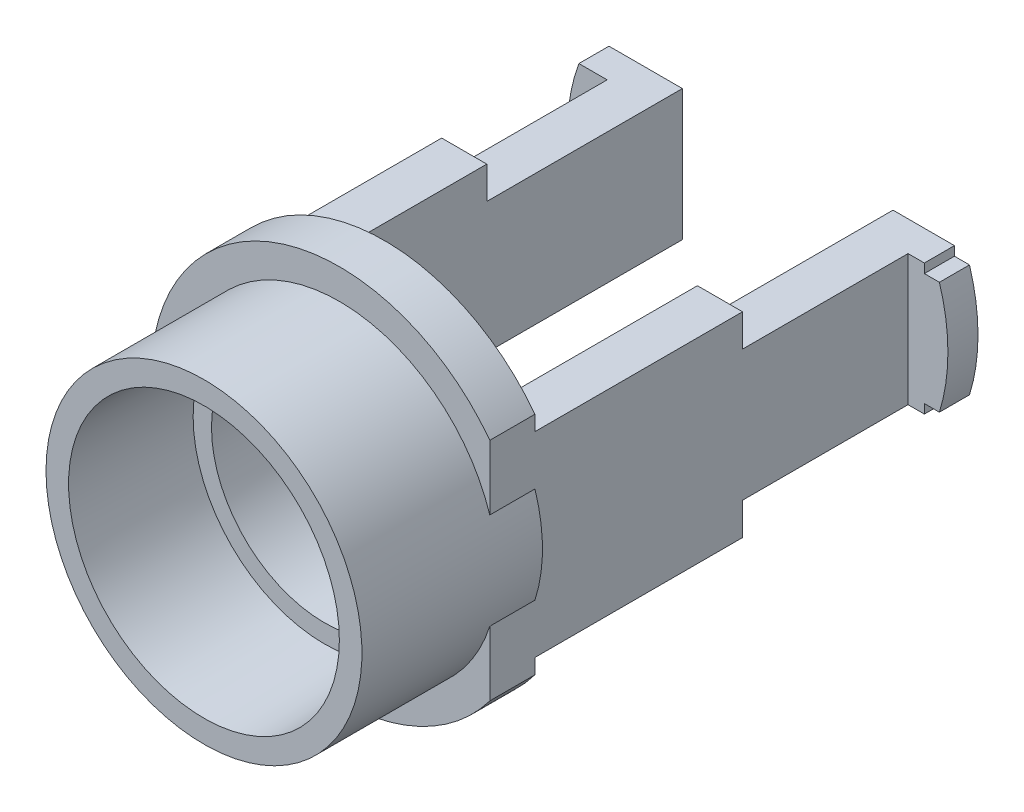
ISO-10303-21;
HEADER;
FILE_DESCRIPTION(('STEP AP214'),'2;1');
FILE_NAME('part.step','',(''),(''),'','','');
FILE_SCHEMA(('AUTOMOTIVE_DESIGN { 1 0 10303 214 1 1 1 1 }'));
ENDSEC;
DATA;
#1=APPLICATION_CONTEXT('core data for automotive mechanical design processes');
#2=APPLICATION_PROTOCOL_DEFINITION('international standard','automotive_design',2000,#1);
#3=PRODUCT_CONTEXT('',#1,'mechanical');
#4=PRODUCT('Part','Part','',(#3));
#5=PRODUCT_RELATED_PRODUCT_CATEGORY('part','',(#4));
#6=PRODUCT_DEFINITION_FORMATION('','',#4);
#7=PRODUCT_DEFINITION_CONTEXT('part definition',#1,'design');
#8=PRODUCT_DEFINITION('design','',#6,#7);
#9=PRODUCT_DEFINITION_SHAPE('','',#8);
#10=(LENGTH_UNIT() NAMED_UNIT(*) SI_UNIT(.MILLI.,.METRE.));
#11=(NAMED_UNIT(*) PLANE_ANGLE_UNIT() SI_UNIT($,.RADIAN.));
#12=(NAMED_UNIT(*) SI_UNIT($,.STERADIAN.) SOLID_ANGLE_UNIT());
#13=UNCERTAINTY_MEASURE_WITH_UNIT(LENGTH_MEASURE(1.E-05),#10,'distance_accuracy_value','');
#14=(GEOMETRIC_REPRESENTATION_CONTEXT(3) GLOBAL_UNCERTAINTY_ASSIGNED_CONTEXT((#13)) GLOBAL_UNIT_ASSIGNED_CONTEXT((#10,
#11,#12)) REPRESENTATION_CONTEXT('',''));
#15=CARTESIAN_POINT('',(0.,0.,0.));
#16=DIRECTION('',(0.,0.,1.));
#17=DIRECTION('',(1.,0.,0.));
#18=AXIS2_PLACEMENT_3D('',#15,#16,#17);
#19=CARTESIAN_POINT('',(0.,0.,-1.));
#20=DIRECTION('',(0.,0.,1.));
#21=DIRECTION('',(1.,0.,0.));
#22=AXIS2_PLACEMENT_3D('',#19,#20,#21);
#23=CYLINDRICAL_SURFACE('',#22,6.325);
#24=CARTESIAN_POINT('',(0.,0.,-0.999999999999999));
#25=DIRECTION('',(0.,0.,1.));
#26=DIRECTION('',(1.,0.,0.));
#27=AXIS2_PLACEMENT_3D('',#24,#25,#26);
#28=CIRCLE('',#27,6.325);
#29=CARTESIAN_POINT('',(-5.93927605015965,-2.17499999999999,-1.));
#30=VERTEX_POINT('',#29);
#31=CARTESIAN_POINT('',(-5.93927605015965,2.175,-1.));
#32=VERTEX_POINT('',#31);
#33=EDGE_CURVE('E17',#30,#32,#28,.F.);
#34=ORIENTED_EDGE('',*,*,#33,.F.);
#35=DIRECTION('',(0.,0.,1.));
#36=VECTOR('',#35,1.);
#37=CARTESIAN_POINT('',(-5.93927605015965,-2.17499999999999,-1.));
#38=LINE('',#37,#36);
#39=CARTESIAN_POINT('',(-5.93927605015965,-2.17499999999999,0.));
#40=VERTEX_POINT('',#39);
#41=EDGE_CURVE('E101',#30,#40,#38,.T.);
#42=ORIENTED_EDGE('',*,*,#41,.T.);
#43=CARTESIAN_POINT('',(0.,0.,0.));
#44=DIRECTION('',(0.,0.,1.));
#45=DIRECTION('',(1.,0.,0.));
#46=AXIS2_PLACEMENT_3D('',#43,#44,#45);
#47=CIRCLE('',#46,6.325);
#48=CARTESIAN_POINT('',(-5.93927605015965,2.175,0.));
#49=VERTEX_POINT('',#48);
#50=EDGE_CURVE('E206',#40,#49,#47,.F.);
#51=ORIENTED_EDGE('',*,*,#50,.T.);
#52=DIRECTION('',(0.,0.,1.));
#53=VECTOR('',#52,1.);
#54=CARTESIAN_POINT('',(-5.93927605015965,2.175,0.));
#55=LINE('',#54,#53);
#56=EDGE_CURVE('E203',#32,#49,#55,.T.);
#57=ORIENTED_EDGE('',*,*,#56,.F.);
#58=EDGE_LOOP('',(#34,#42,#51,#57));
#59=FACE_BOUND('',#58,.T.);
#60=ADVANCED_FACE('F14',(#59),#23,.T.);
#61=CARTESIAN_POINT('',(0.,0.,-1.));
#62=DIRECTION('',(0.,0.,-1.));
#63=DIRECTION('',(-1.,0.,0.));
#64=AXIS2_PLACEMENT_3D('',#61,#62,#63);
#65=PLANE('',#64);
#66=DIRECTION('',(0.,1.,0.));
#67=VECTOR('',#66,1.);
#68=CARTESIAN_POINT('',(-3.5,-3.25,-1.));
#69=LINE('',#68,#67);
#70=CARTESIAN_POINT('',(-3.5,-2.175,-1.));
#71=VERTEX_POINT('',#70);
#72=CARTESIAN_POINT('',(-3.5,2.175,-1.));
#73=VERTEX_POINT('',#72);
#74=EDGE_CURVE('E281',#71,#73,#69,.T.);
#75=ORIENTED_EDGE('',*,*,#74,.F.);
#76=DIRECTION('',(1.,0.,0.));
#77=VECTOR('',#76,1.);
#78=CARTESIAN_POINT('',(-5.,-2.175,-1.));
#79=LINE('',#78,#77);
#80=EDGE_CURVE('E198',#30,#71,#79,.T.);
#81=ORIENTED_EDGE('',*,*,#80,.F.);
#82=ORIENTED_EDGE('',*,*,#33,.T.);
#83=DIRECTION('',(1.,0.,0.));
#84=VECTOR('',#83,1.);
#85=CARTESIAN_POINT('',(-3.5,2.175,-1.));
#86=LINE('',#85,#84);
#87=EDGE_CURVE('E207',#73,#32,#86,.F.);
#88=ORIENTED_EDGE('',*,*,#87,.F.);
#89=EDGE_LOOP('',(#75,#81,#82,#88));
#90=FACE_BOUND('',#89,.T.);
#91=ADVANCED_FACE('F748',(#90),#65,.T.);
#92=CARTESIAN_POINT('',(-3.5,-3.25,12.4));
#93=DIRECTION('',(0.,0.,1.));
#94=DIRECTION('',(0.,-1.,0.));
#95=AXIS2_PLACEMENT_3D('',#92,#93,#94);
#96=PLANE('',#95);
#97=DIRECTION('',(0.,1.,0.));
#98=VECTOR('',#97,1.);
#99=CARTESIAN_POINT('',(-3.5,-3.25,12.4));
#100=LINE('',#99,#98);
#101=CARTESIAN_POINT('',(-3.5,1.34629120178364,12.4));
#102=VERTEX_POINT('',#101);
#103=CARTESIAN_POINT('',(-3.5,-1.34629120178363,12.4));
#104=VERTEX_POINT('',#103);
#105=EDGE_CURVE('E175',#102,#104,#100,.F.);
#106=ORIENTED_EDGE('',*,*,#105,.F.);
#107=CARTESIAN_POINT('',(0.,0.,12.4));
#108=DIRECTION('',(0.,0.,-1.));
#109=DIRECTION('',(-1.,0.,0.));
#110=AXIS2_PLACEMENT_3D('',#107,#108,#109);
#111=CIRCLE('',#110,3.75);
#112=EDGE_CURVE('E254',#102,#104,#111,.F.);
#113=ORIENTED_EDGE('',*,*,#112,.T.);
#114=EDGE_LOOP('',(#106,#113));
#115=FACE_BOUND('',#114,.T.);
#116=ADVANCED_FACE('F741',(#115),#96,.T.);
#117=CARTESIAN_POINT('',(-3.5,3.25,5.5));
#118=DIRECTION('',(0.,1.,0.));
#119=DIRECTION('',(0.,0.,1.));
#120=AXIS2_PLACEMENT_3D('',#117,#118,#119);
#121=PLANE('',#120);
#122=DIRECTION('',(1.,0.,0.));
#123=VECTOR('',#122,1.);
#124=CARTESIAN_POINT('',(-3.5,3.25,5.5));
#125=LINE('',#124,#123);
#126=CARTESIAN_POINT('',(-3.5,3.25,5.5));
#127=VERTEX_POINT('',#126);
#128=CARTESIAN_POINT('',(-5.,3.25,5.5));
#129=VERTEX_POINT('',#128);
#130=EDGE_CURVE('E166',#127,#129,#125,.F.);
#131=ORIENTED_EDGE('',*,*,#130,.T.);
#132=DIRECTION('',(0.,0.,1.));
#133=VECTOR('',#132,1.);
#134=CARTESIAN_POINT('',(-5.,3.25,5.5));
#135=LINE('',#134,#133);
#136=CARTESIAN_POINT('',(-5.,3.25,12.4));
#137=VERTEX_POINT('',#136);
#138=EDGE_CURVE('E169',#137,#129,#135,.F.);
#139=ORIENTED_EDGE('',*,*,#138,.F.);
#140=DIRECTION('',(1.,0.,0.));
#141=VECTOR('',#140,1.);
#142=CARTESIAN_POINT('',(-3.5,3.25,12.4));
#143=LINE('',#142,#141);
#144=CARTESIAN_POINT('',(-3.5,3.25,12.4));
#145=VERTEX_POINT('',#144);
#146=EDGE_CURVE('E155',#137,#145,#143,.T.);
#147=ORIENTED_EDGE('',*,*,#146,.T.);
#148=DIRECTION('',(0.,0.,1.));
#149=VECTOR('',#148,1.);
#150=CARTESIAN_POINT('',(-3.5,3.25,5.5));
#151=LINE('',#150,#149);
#152=EDGE_CURVE('E275',#127,#145,#151,.T.);
#153=ORIENTED_EDGE('',*,*,#152,.F.);
#154=EDGE_LOOP('',(#131,#139,#147,#153));
#155=FACE_BOUND('',#154,.T.);
#156=ADVANCED_FACE('F170',(#155),#121,.T.);
#157=CARTESIAN_POINT('',(-3.5,-3.25,5.5));
#158=DIRECTION('',(0.,0.,1.));
#159=DIRECTION('',(0.,-1.,0.));
#160=AXIS2_PLACEMENT_3D('',#157,#158,#159);
#161=PLANE('',#160);
#162=DIRECTION('',(1.,0.,0.));
#163=VECTOR('',#162,1.);
#164=CARTESIAN_POINT('',(-3.5,2.175,5.5));
#165=LINE('',#164,#163);
#166=CARTESIAN_POINT('',(-5.,2.175,5.5));
#167=VERTEX_POINT('',#166);
#168=CARTESIAN_POINT('',(-3.5,2.175,5.5));
#169=VERTEX_POINT('',#168);
#170=EDGE_CURVE('E278',#167,#169,#165,.T.);
#171=ORIENTED_EDGE('',*,*,#170,.F.);
#172=DIRECTION('',(0.,1.,0.));
#173=VECTOR('',#172,1.);
#174=CARTESIAN_POINT('',(-5.,-3.25,5.5));
#175=LINE('',#174,#173);
#176=EDGE_CURVE('E174',#129,#167,#175,.F.);
#177=ORIENTED_EDGE('',*,*,#176,.F.);
#178=ORIENTED_EDGE('',*,*,#130,.F.);
#179=DIRECTION('',(0.,1.,0.));
#180=VECTOR('',#179,1.);
#181=CARTESIAN_POINT('',(-3.5,-3.25,5.5));
#182=LINE('',#181,#180);
#183=EDGE_CURVE('E272',#169,#127,#182,.T.);
#184=ORIENTED_EDGE('',*,*,#183,.F.);
#185=EDGE_LOOP('',(#171,#177,#178,#184));
#186=FACE_BOUND('',#185,.T.);
#187=ADVANCED_FACE('F727',(#186),#161,.F.);
#188=CARTESIAN_POINT('',(-3.5,2.175,0.));
#189=DIRECTION('',(0.,1.,0.));
#190=DIRECTION('',(0.,0.,1.));
#191=AXIS2_PLACEMENT_3D('',#188,#189,#190);
#192=PLANE('',#191);
#193=DIRECTION('',(-1.,0.,0.));
#194=VECTOR('',#193,1.);
#195=CARTESIAN_POINT('',(0.,2.175,0.));
#196=LINE('',#195,#194);
#197=CARTESIAN_POINT('',(-5.,2.175,0.));
#198=VERTEX_POINT('',#197);
#199=EDGE_CURVE('E199',#49,#198,#196,.F.);
#200=ORIENTED_EDGE('',*,*,#199,.T.);
#201=DIRECTION('',(0.,0.,1.));
#202=VECTOR('',#201,1.);
#203=CARTESIAN_POINT('',(-5.,2.175,5.5));
#204=LINE('',#203,#202);
#205=EDGE_CURVE('E202',#167,#198,#204,.F.);
#206=ORIENTED_EDGE('',*,*,#205,.F.);
#207=ORIENTED_EDGE('',*,*,#170,.T.);
#208=DIRECTION('',(0.,0.,1.));
#209=VECTOR('',#208,1.);
#210=CARTESIAN_POINT('',(-3.5,2.175,5.5));
#211=LINE('',#210,#209);
#212=EDGE_CURVE('E276',#73,#169,#211,.T.);
#213=ORIENTED_EDGE('',*,*,#212,.F.);
#214=ORIENTED_EDGE('',*,*,#87,.T.);
#215=ORIENTED_EDGE('',*,*,#56,.T.);
#216=EDGE_LOOP('',(#200,#206,#207,#213,#214,#215));
#217=FACE_BOUND('',#216,.T.);
#218=ADVANCED_FACE('F591',(#217),#192,.T.);
#219=CARTESIAN_POINT('',(0.,0.,0.));
#220=DIRECTION('',(0.,0.,-1.));
#221=DIRECTION('',(-1.,0.,0.));
#222=AXIS2_PLACEMENT_3D('',#219,#220,#221);
#223=PLANE('',#222);
#224=ORIENTED_EDGE('',*,*,#199,.F.);
#225=ORIENTED_EDGE('',*,*,#50,.F.);
#226=DIRECTION('',(1.,0.,0.));
#227=VECTOR('',#226,1.);
#228=CARTESIAN_POINT('',(-5.,-2.175,0.));
#229=LINE('',#228,#227);
#230=CARTESIAN_POINT('',(-5.,-2.175,0.));
#231=VERTEX_POINT('',#230);
#232=EDGE_CURVE('E196',#231,#40,#229,.F.);
#233=ORIENTED_EDGE('',*,*,#232,.F.);
#234=DIRECTION('',(0.,1.,0.));
#235=VECTOR('',#234,1.);
#236=CARTESIAN_POINT('',(-5.,-3.25,0.));
#237=LINE('',#236,#235);
#238=EDGE_CURVE('E195',#198,#231,#237,.F.);
#239=ORIENTED_EDGE('',*,*,#238,.F.);
#240=EDGE_LOOP('',(#224,#225,#233,#239));
#241=FACE_BOUND('',#240,.T.);
#242=ADVANCED_FACE('F717',(#241),#223,.F.);
#243=CARTESIAN_POINT('',(-5.,-2.175,0.));
#244=DIRECTION('',(0.,-1.,0.));
#245=DIRECTION('',(1.,0.,0.));
#246=AXIS2_PLACEMENT_3D('',#243,#244,#245);
#247=PLANE('',#246);
#248=ORIENTED_EDGE('',*,*,#80,.T.);
#249=DIRECTION('',(0.,0.,1.));
#250=VECTOR('',#249,1.);
#251=CARTESIAN_POINT('',(-3.5,-2.175,5.5));
#252=LINE('',#251,#250);
#253=CARTESIAN_POINT('',(-3.5,-2.175,5.5));
#254=VERTEX_POINT('',#253);
#255=EDGE_CURVE('E287',#254,#71,#252,.F.);
#256=ORIENTED_EDGE('',*,*,#255,.F.);
#257=DIRECTION('',(1.,0.,0.));
#258=VECTOR('',#257,1.);
#259=CARTESIAN_POINT('',(-3.5,-2.175,5.5));
#260=LINE('',#259,#258);
#261=CARTESIAN_POINT('',(-5.,-2.175,5.5));
#262=VERTEX_POINT('',#261);
#263=EDGE_CURVE('E292',#254,#262,#260,.F.);
#264=ORIENTED_EDGE('',*,*,#263,.T.);
#265=DIRECTION('',(0.,0.,1.));
#266=VECTOR('',#265,1.);
#267=CARTESIAN_POINT('',(-5.,-2.175,5.5));
#268=LINE('',#267,#266);
#269=EDGE_CURVE('E192',#231,#262,#268,.T.);
#270=ORIENTED_EDGE('',*,*,#269,.F.);
#271=ORIENTED_EDGE('',*,*,#232,.T.);
#272=ORIENTED_EDGE('',*,*,#41,.F.);
#273=EDGE_LOOP('',(#248,#256,#264,#270,#271,#272));
#274=FACE_BOUND('',#273,.T.);
#275=ADVANCED_FACE('F710',(#274),#247,.T.);
#276=CARTESIAN_POINT('',(-3.5,-3.25,5.5));
#277=DIRECTION('',(0.,0.,1.));
#278=DIRECTION('',(0.,-1.,0.));
#279=AXIS2_PLACEMENT_3D('',#276,#277,#278);
#280=PLANE('',#279);
#281=ORIENTED_EDGE('',*,*,#263,.F.);
#282=DIRECTION('',(0.,1.,0.));
#283=VECTOR('',#282,1.);
#284=CARTESIAN_POINT('',(-3.5,-3.25,5.5));
#285=LINE('',#284,#283);
#286=CARTESIAN_POINT('',(-3.5,-3.25,5.5));
#287=VERTEX_POINT('',#286);
#288=EDGE_CURVE('E290',#287,#254,#285,.T.);
#289=ORIENTED_EDGE('',*,*,#288,.F.);
#290=DIRECTION('',(1.,0.,0.));
#291=VECTOR('',#290,1.);
#292=CARTESIAN_POINT('',(-3.5,-3.25,5.5));
#293=LINE('',#292,#291);
#294=CARTESIAN_POINT('',(-5.,-3.25,5.5));
#295=VERTEX_POINT('',#294);
#296=EDGE_CURVE('E110',#295,#287,#293,.T.);
#297=ORIENTED_EDGE('',*,*,#296,.F.);
#298=DIRECTION('',(0.,1.,0.));
#299=VECTOR('',#298,1.);
#300=CARTESIAN_POINT('',(-5.,-3.25,5.5));
#301=LINE('',#300,#299);
#302=EDGE_CURVE('E190',#262,#295,#301,.F.);
#303=ORIENTED_EDGE('',*,*,#302,.F.);
#304=EDGE_LOOP('',(#281,#289,#297,#303));
#305=FACE_BOUND('',#304,.T.);
#306=ADVANCED_FACE('F305',(#305),#280,.F.);
#307=CARTESIAN_POINT('',(-3.5,-3.25,5.5));
#308=DIRECTION('',(0.,-1.,0.));
#309=DIRECTION('',(1.,0.,0.));
#310=AXIS2_PLACEMENT_3D('',#307,#308,#309);
#311=PLANE('',#310);
#312=ORIENTED_EDGE('',*,*,#296,.T.);
#313=DIRECTION('',(0.,0.,1.));
#314=VECTOR('',#313,1.);
#315=CARTESIAN_POINT('',(-3.5,-3.25,5.5));
#316=LINE('',#315,#314);
#317=CARTESIAN_POINT('',(-3.5,-3.25,12.4));
#318=VERTEX_POINT('',#317);
#319=EDGE_CURVE('E257',#318,#287,#316,.F.);
#320=ORIENTED_EDGE('',*,*,#319,.F.);
#321=DIRECTION('',(1.,0.,0.));
#322=VECTOR('',#321,1.);
#323=CARTESIAN_POINT('',(-3.5,-3.25,12.4));
#324=LINE('',#323,#322);
#325=CARTESIAN_POINT('',(-5.,-3.25,12.4));
#326=VERTEX_POINT('',#325);
#327=EDGE_CURVE('E296',#318,#326,#324,.F.);
#328=ORIENTED_EDGE('',*,*,#327,.T.);
#329=DIRECTION('',(0.,0.,1.));
#330=VECTOR('',#329,1.);
#331=CARTESIAN_POINT('',(-5.,-3.25,5.5));
#332=LINE('',#331,#330);
#333=EDGE_CURVE('E180',#295,#326,#332,.T.);
#334=ORIENTED_EDGE('',*,*,#333,.F.);
#335=EDGE_LOOP('',(#312,#320,#328,#334));
#336=FACE_BOUND('',#335,.T.);
#337=ADVANCED_FACE('F308',(#336),#311,.T.);
#338=CARTESIAN_POINT('',(3.5,-3.24999999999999,12.4));
#339=DIRECTION('',(0.,0.,-1.));
#340=DIRECTION('',(-1.,0.,0.));
#341=AXIS2_PLACEMENT_3D('',#338,#339,#340);
#342=PLANE('',#341);
#343=DIRECTION('',(0.,1.,0.));
#344=VECTOR('',#343,1.);
#345=CARTESIAN_POINT('',(3.5,-3.24999999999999,12.4));
#346=LINE('',#345,#344);
#347=CARTESIAN_POINT('',(3.5,1.34629120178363,12.4));
#348=VERTEX_POINT('',#347);
#349=CARTESIAN_POINT('',(3.5,-1.34629120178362,12.4));
#350=VERTEX_POINT('',#349);
#351=EDGE_CURVE('E249',#348,#350,#346,.F.);
#352=ORIENTED_EDGE('',*,*,#351,.T.);
#353=CARTESIAN_POINT('',(0.,0.,12.4));
#354=DIRECTION('',(0.,0.,-1.));
#355=DIRECTION('',(-1.,0.,0.));
#356=AXIS2_PLACEMENT_3D('',#353,#354,#355);
#357=CIRCLE('',#356,3.75);
#358=EDGE_CURVE('E258',#350,#348,#357,.F.);
#359=ORIENTED_EDGE('',*,*,#358,.T.);
#360=EDGE_LOOP('',(#352,#359));
#361=FACE_BOUND('',#360,.T.);
#362=ADVANCED_FACE('F699',(#361),#342,.F.);
#363=CARTESIAN_POINT('',(0.,0.,66.4));
#364=DIRECTION('',(0.,0.,-1.));
#365=DIRECTION('',(-1.,0.,0.));
#366=AXIS2_PLACEMENT_3D('',#363,#364,#365);
#367=CYLINDRICAL_SURFACE('',#366,3.75);
#368=CARTESIAN_POINT('',(0.,0.,14.4));
#369=DIRECTION('',(0.,0.,-1.));
#370=DIRECTION('',(-1.,0.,0.));
#371=AXIS2_PLACEMENT_3D('',#368,#369,#370);
#372=CIRCLE('',#371,3.75);
#373=CARTESIAN_POINT('',(-3.75,0.,14.4));
#374=VERTEX_POINT('',#373);
#375=EDGE_CURVE('E246',#374,#374,#372,.T.);
#376=ORIENTED_EDGE('',*,*,#375,.F.);
#377=EDGE_LOOP('',(#376));
#378=FACE_BOUND('',#377,.T.);
#379=CARTESIAN_POINT('',(0.,0.,12.4));
#380=DIRECTION('',(0.,0.,-1.));
#381=DIRECTION('',(-1.,0.,0.));
#382=AXIS2_PLACEMENT_3D('',#379,#380,#381);
#383=CIRCLE('',#382,3.75);
#384=EDGE_CURVE('E241',#104,#350,#383,.F.);
#385=ORIENTED_EDGE('',*,*,#384,.F.);
#386=ORIENTED_EDGE('',*,*,#112,.F.);
#387=CARTESIAN_POINT('',(0.,0.,12.4));
#388=DIRECTION('',(0.,0.,-1.));
#389=DIRECTION('',(-1.,0.,0.));
#390=AXIS2_PLACEMENT_3D('',#387,#388,#389);
#391=CIRCLE('',#390,3.75);
#392=EDGE_CURVE('E186',#348,#102,#391,.F.);
#393=ORIENTED_EDGE('',*,*,#392,.F.);
#394=ORIENTED_EDGE('',*,*,#358,.F.);
#395=EDGE_LOOP('',(#385,#386,#393,#394));
#396=FACE_BOUND('',#395,.T.);
#397=ADVANCED_FACE('F794',(#378,#396),#367,.F.);
#398=CARTESIAN_POINT('',(-3.5,-3.25,5.5));
#399=DIRECTION('',(1.,0.,0.));
#400=DIRECTION('',(0.,1.,0.));
#401=AXIS2_PLACEMENT_3D('',#398,#399,#400);
#402=PLANE('',#401);
#403=DIRECTION('',(0.,1.,0.));
#404=VECTOR('',#403,1.);
#405=CARTESIAN_POINT('',(-3.5,3.75,12.4));
#406=LINE('',#405,#404);
#407=EDGE_CURVE('E165',#102,#145,#406,.T.);
#408=ORIENTED_EDGE('',*,*,#407,.F.);
#409=ORIENTED_EDGE('',*,*,#105,.T.);
#410=DIRECTION('',(0.,1.,0.));
#411=VECTOR('',#410,1.);
#412=CARTESIAN_POINT('',(-3.5,3.75,12.4));
#413=LINE('',#412,#411);
#414=EDGE_CURVE('E245',#318,#104,#413,.T.);
#415=ORIENTED_EDGE('',*,*,#414,.F.);
#416=ORIENTED_EDGE('',*,*,#319,.T.);
#417=ORIENTED_EDGE('',*,*,#288,.T.);
#418=ORIENTED_EDGE('',*,*,#255,.T.);
#419=ORIENTED_EDGE('',*,*,#74,.T.);
#420=ORIENTED_EDGE('',*,*,#212,.T.);
#421=ORIENTED_EDGE('',*,*,#183,.T.);
#422=ORIENTED_EDGE('',*,*,#152,.T.);
#423=EDGE_LOOP('',(#408,#409,#415,#416,#417,#418,#419,#420,#421,#422));
#424=FACE_BOUND('',#423,.T.);
#425=ADVANCED_FACE('F843',(#424),#402,.T.);
#426=CARTESIAN_POINT('',(-5.,-3.25,5.5));
#427=DIRECTION('',(-1.,0.,0.));
#428=DIRECTION('',(0.,0.,1.));
#429=AXIS2_PLACEMENT_3D('',#426,#427,#428);
#430=PLANE('',#429);
#431=ORIENTED_EDGE('',*,*,#302,.T.);
#432=ORIENTED_EDGE('',*,*,#333,.T.);
#433=DIRECTION('',(0.,1.,0.));
#434=VECTOR('',#433,1.);
#435=CARTESIAN_POINT('',(-5.,3.75,12.4));
#436=LINE('',#435,#434);
#437=EDGE_CURVE('E162',#137,#326,#436,.F.);
#438=ORIENTED_EDGE('',*,*,#437,.F.);
#439=ORIENTED_EDGE('',*,*,#138,.T.);
#440=ORIENTED_EDGE('',*,*,#176,.T.);
#441=ORIENTED_EDGE('',*,*,#205,.T.);
#442=ORIENTED_EDGE('',*,*,#238,.T.);
#443=ORIENTED_EDGE('',*,*,#269,.T.);
#444=EDGE_LOOP('',(#431,#432,#438,#439,#440,#441,#442,#443));
#445=FACE_BOUND('',#444,.T.);
#446=ADVANCED_FACE('F179',(#445),#430,.T.);
#447=CARTESIAN_POINT('',(5.54224502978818,-1.86999999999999,-1.));
#448=DIRECTION('',(1.,0.,0.));
#449=DIRECTION('',(0.,1.,0.));
#450=AXIS2_PLACEMENT_3D('',#447,#448,#449);
#451=PLANE('',#450);
#452=DIRECTION('',(0.,-1.,0.));
#453=VECTOR('',#452,1.);
#454=CARTESIAN_POINT('',(5.54224502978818,0.,-1.));
#455=LINE('',#454,#453);
#456=CARTESIAN_POINT('',(5.54224502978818,-2.17499999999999,-1.));
#457=VERTEX_POINT('',#456);
#458=CARTESIAN_POINT('',(5.54224502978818,-1.86999999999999,-1.));
#459=VERTEX_POINT('',#458);
#460=EDGE_CURVE('E321',#457,#459,#455,.F.);
#461=ORIENTED_EDGE('',*,*,#460,.T.);
#462=DIRECTION('',(0.,0.,1.));
#463=VECTOR('',#462,1.);
#464=CARTESIAN_POINT('',(5.54224502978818,-1.86999999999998,-1.));
#465=LINE('',#464,#463);
#466=CARTESIAN_POINT('',(5.54224502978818,-1.86999999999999,0.));
#467=VERTEX_POINT('',#466);
#468=EDGE_CURVE('E298',#467,#459,#465,.F.);
#469=ORIENTED_EDGE('',*,*,#468,.F.);
#470=DIRECTION('',(0.,-1.,0.));
#471=VECTOR('',#470,1.);
#472=CARTESIAN_POINT('',(5.54224502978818,0.,0.));
#473=LINE('',#472,#471);
#474=CARTESIAN_POINT('',(5.54224502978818,-2.17499999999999,0.));
#475=VERTEX_POINT('',#474);
#476=EDGE_CURVE('E334',#475,#467,#473,.F.);
#477=ORIENTED_EDGE('',*,*,#476,.F.);
#478=DIRECTION('',(0.,0.,1.));
#479=VECTOR('',#478,1.);
#480=CARTESIAN_POINT('',(5.54224502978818,-2.17499999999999,0.));
#481=LINE('',#480,#479);
#482=EDGE_CURVE('E340',#457,#475,#481,.T.);
#483=ORIENTED_EDGE('',*,*,#482,.F.);
#484=EDGE_LOOP('',(#461,#469,#477,#483));
#485=FACE_BOUND('',#484,.T.);
#486=ADVANCED_FACE('F481',(#485),#451,.T.);
#487=CARTESIAN_POINT('',(6.04224502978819,-1.86999999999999,-1.));
#488=DIRECTION('',(0.,-1.,0.));
#489=DIRECTION('',(1.,0.,0.));
#490=AXIS2_PLACEMENT_3D('',#487,#488,#489);
#491=PLANE('',#490);
#492=DIRECTION('',(1.,0.,0.));
#493=VECTOR('',#492,1.);
#494=CARTESIAN_POINT('',(0.,-1.86999999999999,-1.));
#495=LINE('',#494,#493);
#496=CARTESIAN_POINT('',(6.04224502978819,-1.86999999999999,-1.));
#497=VERTEX_POINT('',#496);
#498=EDGE_CURVE('E253',#459,#497,#495,.T.);
#499=ORIENTED_EDGE('',*,*,#498,.T.);
#500=DIRECTION('',(0.,0.,1.));
#501=VECTOR('',#500,1.);
#502=CARTESIAN_POINT('',(6.04224502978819,-1.86999999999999,-0.999999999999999));
#503=LINE('',#502,#501);
#504=CARTESIAN_POINT('',(6.04224502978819,-1.86999999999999,0.));
#505=VERTEX_POINT('',#504);
#506=EDGE_CURVE('E300',#505,#497,#503,.F.);
#507=ORIENTED_EDGE('',*,*,#506,.F.);
#508=DIRECTION('',(1.,0.,0.));
#509=VECTOR('',#508,1.);
#510=CARTESIAN_POINT('',(0.,-1.86999999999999,0.));
#511=LINE('',#510,#509);
#512=EDGE_CURVE('E238',#467,#505,#511,.T.);
#513=ORIENTED_EDGE('',*,*,#512,.F.);
#514=ORIENTED_EDGE('',*,*,#468,.T.);
#515=EDGE_LOOP('',(#499,#507,#513,#514));
#516=FACE_BOUND('',#515,.T.);
#517=ADVANCED_FACE('F488',(#516),#491,.T.);
#518=CARTESIAN_POINT('',(0.,0.,-1.));
#519=DIRECTION('',(0.,0.,1.));
#520=DIRECTION('',(1.,0.,0.));
#521=AXIS2_PLACEMENT_3D('',#518,#519,#520);
#522=CYLINDRICAL_SURFACE('',#521,6.325);
#523=CARTESIAN_POINT('',(0.,0.,-1.));
#524=DIRECTION('',(0.,0.,1.));
#525=DIRECTION('',(1.,0.,0.));
#526=AXIS2_PLACEMENT_3D('',#523,#524,#525);
#527=CIRCLE('',#526,6.325);
#528=CARTESIAN_POINT('',(6.04224502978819,1.87000000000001,-1.));
#529=VERTEX_POINT('',#528);
#530=EDGE_CURVE('E250',#497,#529,#527,.T.);
#531=ORIENTED_EDGE('',*,*,#530,.T.);
#532=DIRECTION('',(0.,0.,1.));
#533=VECTOR('',#532,1.);
#534=CARTESIAN_POINT('',(6.04224502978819,1.87000000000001,-1.));
#535=LINE('',#534,#533);
#536=CARTESIAN_POINT('',(6.04224502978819,1.87000000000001,0.));
#537=VERTEX_POINT('',#536);
#538=EDGE_CURVE('E322',#537,#529,#535,.F.);
#539=ORIENTED_EDGE('',*,*,#538,.F.);
#540=CARTESIAN_POINT('',(0.,0.,0.));
#541=DIRECTION('',(0.,0.,1.));
#542=DIRECTION('',(1.,0.,0.));
#543=AXIS2_PLACEMENT_3D('',#540,#541,#542);
#544=CIRCLE('',#543,6.325);
#545=EDGE_CURVE('E234',#505,#537,#544,.T.);
#546=ORIENTED_EDGE('',*,*,#545,.F.);
#547=ORIENTED_EDGE('',*,*,#506,.T.);
#548=EDGE_LOOP('',(#531,#539,#546,#547));
#549=FACE_BOUND('',#548,.T.);
#550=ADVANCED_FACE('F494',(#549),#522,.T.);
#551=CARTESIAN_POINT('',(5.54224502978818,1.87000000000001,-1.));
#552=DIRECTION('',(0.,1.,0.));
#553=DIRECTION('',(0.,0.,1.));
#554=AXIS2_PLACEMENT_3D('',#551,#552,#553);
#555=PLANE('',#554);
#556=DIRECTION('',(1.,0.,0.));
#557=VECTOR('',#556,1.);
#558=CARTESIAN_POINT('',(0.,1.87000000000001,-1.));
#559=LINE('',#558,#557);
#560=CARTESIAN_POINT('',(5.54224502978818,1.87000000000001,-1.));
#561=VERTEX_POINT('',#560);
#562=EDGE_CURVE('E252',#529,#561,#559,.F.);
#563=ORIENTED_EDGE('',*,*,#562,.T.);
#564=DIRECTION('',(0.,0.,1.));
#565=VECTOR('',#564,1.);
#566=CARTESIAN_POINT('',(5.54224502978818,1.87000000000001,-1.));
#567=LINE('',#566,#565);
#568=CARTESIAN_POINT('',(5.54224502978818,1.87000000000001,0.));
#569=VERTEX_POINT('',#568);
#570=EDGE_CURVE('E325',#569,#561,#567,.F.);
#571=ORIENTED_EDGE('',*,*,#570,.F.);
#572=DIRECTION('',(1.,0.,0.));
#573=VECTOR('',#572,1.);
#574=CARTESIAN_POINT('',(0.,1.87000000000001,0.));
#575=LINE('',#574,#573);
#576=EDGE_CURVE('E237',#537,#569,#575,.F.);
#577=ORIENTED_EDGE('',*,*,#576,.F.);
#578=ORIENTED_EDGE('',*,*,#538,.T.);
#579=EDGE_LOOP('',(#563,#571,#577,#578));
#580=FACE_BOUND('',#579,.T.);
#581=ADVANCED_FACE('F498',(#580),#555,.T.);
#582=CARTESIAN_POINT('',(5.54224502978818,2.175,-1.));
#583=DIRECTION('',(1.,0.,0.));
#584=DIRECTION('',(0.,1.,0.));
#585=AXIS2_PLACEMENT_3D('',#582,#583,#584);
#586=PLANE('',#585);
#587=DIRECTION('',(0.,-1.,0.));
#588=VECTOR('',#587,1.);
#589=CARTESIAN_POINT('',(5.54224502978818,0.,-1.));
#590=LINE('',#589,#588);
#591=CARTESIAN_POINT('',(5.54224502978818,2.175,-1.));
#592=VERTEX_POINT('',#591);
#593=EDGE_CURVE('E269',#561,#592,#590,.F.);
#594=ORIENTED_EDGE('',*,*,#593,.T.);
#595=DIRECTION('',(0.,0.,1.));
#596=VECTOR('',#595,1.);
#597=CARTESIAN_POINT('',(5.54224502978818,2.175,0.));
#598=LINE('',#597,#596);
#599=CARTESIAN_POINT('',(5.54224502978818,2.175,0.));
#600=VERTEX_POINT('',#599);
#601=EDGE_CURVE('E399',#600,#592,#598,.F.);
#602=ORIENTED_EDGE('',*,*,#601,.F.);
#603=DIRECTION('',(0.,-1.,0.));
#604=VECTOR('',#603,1.);
#605=CARTESIAN_POINT('',(5.54224502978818,0.,0.));
#606=LINE('',#605,#604);
#607=EDGE_CURVE('E326',#569,#600,#606,.F.);
#608=ORIENTED_EDGE('',*,*,#607,.F.);
#609=ORIENTED_EDGE('',*,*,#570,.T.);
#610=EDGE_LOOP('',(#594,#602,#608,#609));
#611=FACE_BOUND('',#610,.T.);
#612=ADVANCED_FACE('F649',(#611),#586,.T.);
#613=CARTESIAN_POINT('',(0.,0.,-1.));
#614=DIRECTION('',(0.,0.,1.));
#615=DIRECTION('',(0.,-1.,0.));
#616=AXIS2_PLACEMENT_3D('',#613,#614,#615);
#617=PLANE('',#616);
#618=ORIENTED_EDGE('',*,*,#562,.F.);
#619=ORIENTED_EDGE('',*,*,#530,.F.);
#620=ORIENTED_EDGE('',*,*,#498,.F.);
#621=ORIENTED_EDGE('',*,*,#460,.F.);
#622=DIRECTION('',(1.,0.,0.));
#623=VECTOR('',#622,1.);
#624=CARTESIAN_POINT('',(3.5,-2.17499999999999,-1.));
#625=LINE('',#624,#623);
#626=CARTESIAN_POINT('',(3.5,-2.17499999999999,-1.));
#627=VERTEX_POINT('',#626);
#628=EDGE_CURVE('E343',#627,#457,#625,.T.);
#629=ORIENTED_EDGE('',*,*,#628,.F.);
#630=DIRECTION('',(0.,1.,0.));
#631=VECTOR('',#630,1.);
#632=CARTESIAN_POINT('',(3.5,-3.24999999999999,-1.));
#633=LINE('',#632,#631);
#634=CARTESIAN_POINT('',(3.5,2.175,-1.));
#635=VERTEX_POINT('',#634);
#636=EDGE_CURVE('E360',#627,#635,#633,.T.);
#637=ORIENTED_EDGE('',*,*,#636,.T.);
#638=DIRECTION('',(1.,0.,0.));
#639=VECTOR('',#638,1.);
#640=CARTESIAN_POINT('',(5.,2.175,-1.));
#641=LINE('',#640,#639);
#642=EDGE_CURVE('E397',#592,#635,#641,.F.);
#643=ORIENTED_EDGE('',*,*,#642,.F.);
#644=ORIENTED_EDGE('',*,*,#593,.F.);
#645=EDGE_LOOP('',(#618,#619,#620,#621,#629,#637,#643,#644));
#646=FACE_BOUND('',#645,.T.);
#647=ADVANCED_FACE('F491',(#646),#617,.F.);
#648=CARTESIAN_POINT('',(3.5,-3.24999999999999,5.5));
#649=DIRECTION('',(1.,0.,0.));
#650=DIRECTION('',(0.,1.,0.));
#651=AXIS2_PLACEMENT_3D('',#648,#649,#650);
#652=PLANE('',#651);
#653=ORIENTED_EDGE('',*,*,#351,.F.);
#654=DIRECTION('',(0.,1.,0.));
#655=VECTOR('',#654,1.);
#656=CARTESIAN_POINT('',(3.5,3.75,12.4));
#657=LINE('',#656,#655);
#658=CARTESIAN_POINT('',(3.5,3.25000000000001,12.4));
#659=VERTEX_POINT('',#658);
#660=EDGE_CURVE('E240',#659,#348,#657,.F.);
#661=ORIENTED_EDGE('',*,*,#660,.F.);
#662=DIRECTION('',(0.,0.,1.));
#663=VECTOR('',#662,1.);
#664=CARTESIAN_POINT('',(3.5,3.25000000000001,5.5));
#665=LINE('',#664,#663);
#666=CARTESIAN_POINT('',(3.5,3.25000000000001,5.5));
#667=VERTEX_POINT('',#666);
#668=EDGE_CURVE('E382',#659,#667,#665,.F.);
#669=ORIENTED_EDGE('',*,*,#668,.T.);
#670=DIRECTION('',(0.,1.,0.));
#671=VECTOR('',#670,1.);
#672=CARTESIAN_POINT('',(3.5,-3.24999999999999,5.5));
#673=LINE('',#672,#671);
#674=CARTESIAN_POINT('',(3.5,2.175,5.5));
#675=VERTEX_POINT('',#674);
#676=EDGE_CURVE('E385',#675,#667,#673,.T.);
#677=ORIENTED_EDGE('',*,*,#676,.F.);
#678=DIRECTION('',(0.,0.,1.));
#679=VECTOR('',#678,1.);
#680=CARTESIAN_POINT('',(3.5,2.175,0.));
#681=LINE('',#680,#679);
#682=EDGE_CURVE('E394',#635,#675,#681,.T.);
#683=ORIENTED_EDGE('',*,*,#682,.F.);
#684=ORIENTED_EDGE('',*,*,#636,.F.);
#685=DIRECTION('',(0.,0.,1.));
#686=VECTOR('',#685,1.);
#687=CARTESIAN_POINT('',(3.5,-2.17499999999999,0.));
#688=LINE('',#687,#686);
#689=CARTESIAN_POINT('',(3.5,-2.17499999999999,5.5));
#690=VERTEX_POINT('',#689);
#691=EDGE_CURVE('E354',#690,#627,#688,.F.);
#692=ORIENTED_EDGE('',*,*,#691,.F.);
#693=DIRECTION('',(0.,1.,0.));
#694=VECTOR('',#693,1.);
#695=CARTESIAN_POINT('',(3.5,-3.24999999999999,5.5));
#696=LINE('',#695,#694);
#697=CARTESIAN_POINT('',(3.5,-3.24999999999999,5.5));
#698=VERTEX_POINT('',#697);
#699=EDGE_CURVE('E366',#698,#690,#696,.T.);
#700=ORIENTED_EDGE('',*,*,#699,.F.);
#701=DIRECTION('',(0.,0.,1.));
#702=VECTOR('',#701,1.);
#703=CARTESIAN_POINT('',(3.5,-3.24999999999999,5.5));
#704=LINE('',#703,#702);
#705=CARTESIAN_POINT('',(3.5,-3.24999999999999,12.4));
#706=VERTEX_POINT('',#705);
#707=EDGE_CURVE('E181',#698,#706,#704,.T.);
#708=ORIENTED_EDGE('',*,*,#707,.T.);
#709=DIRECTION('',(0.,1.,0.));
#710=VECTOR('',#709,1.);
#711=CARTESIAN_POINT('',(3.5,3.75,12.4));
#712=LINE('',#711,#710);
#713=EDGE_CURVE('E244',#350,#706,#712,.F.);
#714=ORIENTED_EDGE('',*,*,#713,.F.);
#715=EDGE_LOOP('',(#653,#661,#669,#677,#683,#684,#692,#700,#708,#714));
#716=FACE_BOUND('',#715,.T.);
#717=ADVANCED_FACE('F510',(#716),#652,.F.);
#718=CARTESIAN_POINT('',(0.,4.36031692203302,14.4));
#719=DIRECTION('',(0.,0.,1.));
#720=DIRECTION('',(0.,-1.,0.));
#721=AXIS2_PLACEMENT_3D('',#718,#719,#720);
#722=PLANE('',#721);
#723=ORIENTED_EDGE('',*,*,#375,.T.);
#724=EDGE_LOOP('',(#723));
#725=FACE_BOUND('',#724,.T.);
#726=CARTESIAN_POINT('',(0.,0.,14.4000000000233));
#727=DIRECTION('',(0.,0.,1.));
#728=DIRECTION('',(1.,0.,0.));
#729=AXIS2_PLACEMENT_3D('',#726,#727,#728);
#730=CIRCLE('',#729,4.36031692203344);
#731=CARTESIAN_POINT('',(4.36031692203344,0.,14.4000000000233));
#732=VERTEX_POINT('',#731);
#733=EDGE_CURVE('E230',#732,#732,#730,.T.);
#734=ORIENTED_EDGE('',*,*,#733,.T.);
#735=EDGE_LOOP('',(#734));
#736=FACE_BOUND('',#735,.T.);
#737=ADVANCED_FACE('F777',(#725,#736),#722,.T.);
#738=CARTESIAN_POINT('',(0.,3.75,12.4));
#739=DIRECTION('',(0.,0.,-1.));
#740=DIRECTION('',(-1.,0.,0.));
#741=AXIS2_PLACEMENT_3D('',#738,#739,#740);
#742=PLANE('',#741);
#743=ORIENTED_EDGE('',*,*,#437,.T.);
#744=ORIENTED_EDGE('',*,*,#327,.F.);
#745=ORIENTED_EDGE('',*,*,#414,.T.);
#746=ORIENTED_EDGE('',*,*,#384,.T.);
#747=ORIENTED_EDGE('',*,*,#713,.T.);
#748=DIRECTION('',(1.,0.,0.));
#749=VECTOR('',#748,1.);
#750=CARTESIAN_POINT('',(5.,-3.24999999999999,12.4));
#751=LINE('',#750,#749);
#752=CARTESIAN_POINT('',(5.,-3.24999999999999,12.4));
#753=VERTEX_POINT('',#752);
#754=EDGE_CURVE('E184',#706,#753,#751,.T.);
#755=ORIENTED_EDGE('',*,*,#754,.T.);
#756=DIRECTION('',(0.,1.,0.));
#757=VECTOR('',#756,1.);
#758=CARTESIAN_POINT('',(5.,3.75,12.4));
#759=LINE('',#758,#757);
#760=CARTESIAN_POINT('',(5.,-3.75,12.4));
#761=VERTEX_POINT('',#760);
#762=EDGE_CURVE('E420',#753,#761,#759,.F.);
#763=ORIENTED_EDGE('',*,*,#762,.T.);
#764=CARTESIAN_POINT('',(0.,0.,12.4));
#765=DIRECTION('',(0.,0.,-1.));
#766=DIRECTION('',(-1.,0.,0.));
#767=AXIS2_PLACEMENT_3D('',#764,#765,#766);
#768=CIRCLE('',#767,6.25);
#769=CARTESIAN_POINT('',(5.,3.75000000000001,12.4));
#770=VERTEX_POINT('',#769);
#771=EDGE_CURVE('E226',#770,#761,#768,.F.);
#772=ORIENTED_EDGE('',*,*,#771,.F.);
#773=DIRECTION('',(0.,1.,0.));
#774=VECTOR('',#773,1.);
#775=CARTESIAN_POINT('',(5.,3.75,12.4));
#776=LINE('',#775,#774);
#777=CARTESIAN_POINT('',(5.,3.25000000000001,12.4));
#778=VERTEX_POINT('',#777);
#779=EDGE_CURVE('E418',#770,#778,#776,.F.);
#780=ORIENTED_EDGE('',*,*,#779,.T.);
#781=DIRECTION('',(1.,0.,0.));
#782=VECTOR('',#781,1.);
#783=CARTESIAN_POINT('',(5.,3.25000000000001,12.4));
#784=LINE('',#783,#782);
#785=EDGE_CURVE('E233',#778,#659,#784,.F.);
#786=ORIENTED_EDGE('',*,*,#785,.T.);
#787=ORIENTED_EDGE('',*,*,#660,.T.);
#788=ORIENTED_EDGE('',*,*,#392,.T.);
#789=ORIENTED_EDGE('',*,*,#407,.T.);
#790=ORIENTED_EDGE('',*,*,#146,.F.);
#791=EDGE_LOOP('',(#743,#744,#745,#746,#747,#755,#763,#772,#780,#786,#787,#788,#789,#790));
#792=FACE_BOUND('',#791,.T.);
#793=ADVANCED_FACE('F160',(#792),#742,.T.);
#794=CARTESIAN_POINT('',(5.,-3.24999999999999,5.5));
#795=DIRECTION('',(0.,1.,0.));
#796=DIRECTION('',(0.,0.,1.));
#797=AXIS2_PLACEMENT_3D('',#794,#795,#796);
#798=PLANE('',#797);
#799=ORIENTED_EDGE('',*,*,#707,.F.);
#800=DIRECTION('',(-1.,0.,0.));
#801=VECTOR('',#800,1.);
#802=CARTESIAN_POINT('',(3.5,-3.24999999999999,5.5));
#803=LINE('',#802,#801);
#804=CARTESIAN_POINT('',(5.,-3.25,5.5));
#805=VERTEX_POINT('',#804);
#806=EDGE_CURVE('E365',#805,#698,#803,.T.);
#807=ORIENTED_EDGE('',*,*,#806,.F.);
#808=DIRECTION('',(0.,0.,1.));
#809=VECTOR('',#808,1.);
#810=CARTESIAN_POINT('',(5.,-3.25,31.0681547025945));
#811=LINE('',#810,#809);
#812=EDGE_CURVE('E370',#753,#805,#811,.F.);
#813=ORIENTED_EDGE('',*,*,#812,.F.);
#814=ORIENTED_EDGE('',*,*,#754,.F.);
#815=EDGE_LOOP('',(#799,#807,#813,#814));
#816=FACE_BOUND('',#815,.T.);
#817=ADVANCED_FACE('F432',(#816),#798,.F.);
#818=CARTESIAN_POINT('',(3.5,-3.24999999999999,5.5));
#819=DIRECTION('',(0.,0.,-1.));
#820=DIRECTION('',(-1.,0.,0.));
#821=AXIS2_PLACEMENT_3D('',#818,#819,#820);
#822=PLANE('',#821);
#823=DIRECTION('',(0.,1.,0.));
#824=VECTOR('',#823,1.);
#825=CARTESIAN_POINT('',(5.,3.75000000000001,5.5));
#826=LINE('',#825,#824);
#827=CARTESIAN_POINT('',(5.,-2.17499999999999,5.5));
#828=VERTEX_POINT('',#827);
#829=EDGE_CURVE('E351',#805,#828,#826,.T.);
#830=ORIENTED_EDGE('',*,*,#829,.F.);
#831=ORIENTED_EDGE('',*,*,#806,.T.);
#832=ORIENTED_EDGE('',*,*,#699,.T.);
#833=DIRECTION('',(1.,0.,0.));
#834=VECTOR('',#833,1.);
#835=CARTESIAN_POINT('',(3.5,-2.17499999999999,5.5));
#836=LINE('',#835,#834);
#837=EDGE_CURVE('E359',#828,#690,#836,.F.);
#838=ORIENTED_EDGE('',*,*,#837,.F.);
#839=EDGE_LOOP('',(#830,#831,#832,#838));
#840=FACE_BOUND('',#839,.T.);
#841=ADVANCED_FACE('F627',(#840),#822,.T.);
#842=CARTESIAN_POINT('',(3.5,-2.17499999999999,0.));
#843=DIRECTION('',(0.,-1.,0.));
#844=DIRECTION('',(1.,0.,0.));
#845=AXIS2_PLACEMENT_3D('',#842,#843,#844);
#846=PLANE('',#845);
#847=DIRECTION('',(1.,0.,0.));
#848=VECTOR('',#847,1.);
#849=CARTESIAN_POINT('',(0.,-2.17499999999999,0.));
#850=LINE('',#849,#848);
#851=CARTESIAN_POINT('',(5.,-2.17499999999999,0.));
#852=VERTEX_POINT('',#851);
#853=EDGE_CURVE('E337',#852,#475,#850,.T.);
#854=ORIENTED_EDGE('',*,*,#853,.F.);
#855=DIRECTION('',(0.,0.,1.));
#856=VECTOR('',#855,1.);
#857=CARTESIAN_POINT('',(5.,-2.17499999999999,31.0681547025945));
#858=LINE('',#857,#856);
#859=EDGE_CURVE('E348',#828,#852,#858,.F.);
#860=ORIENTED_EDGE('',*,*,#859,.F.);
#861=ORIENTED_EDGE('',*,*,#837,.T.);
#862=ORIENTED_EDGE('',*,*,#691,.T.);
#863=ORIENTED_EDGE('',*,*,#628,.T.);
#864=ORIENTED_EDGE('',*,*,#482,.T.);
#865=EDGE_LOOP('',(#854,#860,#861,#862,#863,#864));
#866=FACE_BOUND('',#865,.T.);
#867=ADVANCED_FACE('F506',(#866),#846,.T.);
#868=CARTESIAN_POINT('',(0.,0.,0.));
#869=DIRECTION('',(0.,0.,1.));
#870=DIRECTION('',(0.,-1.,0.));
#871=AXIS2_PLACEMENT_3D('',#868,#869,#870);
#872=PLANE('',#871);
#873=ORIENTED_EDGE('',*,*,#607,.T.);
#874=DIRECTION('',(1.,0.,0.));
#875=VECTOR('',#874,1.);
#876=CARTESIAN_POINT('',(5.,2.175,0.));
#877=LINE('',#876,#875);
#878=CARTESIAN_POINT('',(5.,2.175,0.));
#879=VERTEX_POINT('',#878);
#880=EDGE_CURVE('E329',#879,#600,#877,.T.);
#881=ORIENTED_EDGE('',*,*,#880,.F.);
#882=DIRECTION('',(0.,1.,0.));
#883=VECTOR('',#882,1.);
#884=CARTESIAN_POINT('',(5.,3.75000000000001,0.));
#885=LINE('',#884,#883);
#886=EDGE_CURVE('E344',#852,#879,#885,.T.);
#887=ORIENTED_EDGE('',*,*,#886,.F.);
#888=ORIENTED_EDGE('',*,*,#853,.T.);
#889=ORIENTED_EDGE('',*,*,#476,.T.);
#890=ORIENTED_EDGE('',*,*,#512,.T.);
#891=ORIENTED_EDGE('',*,*,#545,.T.);
#892=ORIENTED_EDGE('',*,*,#576,.T.);
#893=EDGE_LOOP('',(#873,#881,#887,#888,#889,#890,#891,#892));
#894=FACE_BOUND('',#893,.T.);
#895=ADVANCED_FACE('F501',(#894),#872,.T.);
#896=CARTESIAN_POINT('',(5.,2.175,0.));
#897=DIRECTION('',(0.,1.,0.));
#898=DIRECTION('',(0.,0.,1.));
#899=AXIS2_PLACEMENT_3D('',#896,#897,#898);
#900=PLANE('',#899);
#901=ORIENTED_EDGE('',*,*,#642,.T.);
#902=ORIENTED_EDGE('',*,*,#682,.T.);
#903=DIRECTION('',(-1.,0.,0.));
#904=VECTOR('',#903,1.);
#905=CARTESIAN_POINT('',(3.5,2.175,5.5));
#906=LINE('',#905,#904);
#907=CARTESIAN_POINT('',(5.,2.175,5.5));
#908=VERTEX_POINT('',#907);
#909=EDGE_CURVE('E396',#908,#675,#906,.T.);
#910=ORIENTED_EDGE('',*,*,#909,.F.);
#911=DIRECTION('',(0.,0.,1.));
#912=VECTOR('',#911,1.);
#913=CARTESIAN_POINT('',(5.,2.175,31.0681547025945));
#914=LINE('',#913,#912);
#915=EDGE_CURVE('E347',#879,#908,#914,.T.);
#916=ORIENTED_EDGE('',*,*,#915,.F.);
#917=ORIENTED_EDGE('',*,*,#880,.T.);
#918=ORIENTED_EDGE('',*,*,#601,.T.);
#919=EDGE_LOOP('',(#901,#902,#910,#916,#917,#918));
#920=FACE_BOUND('',#919,.T.);
#921=ADVANCED_FACE('F514',(#920),#900,.T.);
#922=CARTESIAN_POINT('',(3.5,-3.24999999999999,5.5));
#923=DIRECTION('',(0.,0.,-1.));
#924=DIRECTION('',(-1.,0.,0.));
#925=AXIS2_PLACEMENT_3D('',#922,#923,#924);
#926=PLANE('',#925);
#927=ORIENTED_EDGE('',*,*,#676,.T.);
#928=DIRECTION('',(1.,0.,0.));
#929=VECTOR('',#928,1.);
#930=CARTESIAN_POINT('',(5.,3.25000000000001,5.5));
#931=LINE('',#930,#929);
#932=CARTESIAN_POINT('',(5.,3.25000000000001,5.5));
#933=VERTEX_POINT('',#932);
#934=EDGE_CURVE('E381',#667,#933,#931,.T.);
#935=ORIENTED_EDGE('',*,*,#934,.T.);
#936=DIRECTION('',(0.,1.,0.));
#937=VECTOR('',#936,1.);
#938=CARTESIAN_POINT('',(5.,3.75000000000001,5.5));
#939=LINE('',#938,#937);
#940=EDGE_CURVE('E389',#908,#933,#939,.T.);
#941=ORIENTED_EDGE('',*,*,#940,.F.);
#942=ORIENTED_EDGE('',*,*,#909,.T.);
#943=EDGE_LOOP('',(#927,#935,#941,#942));
#944=FACE_BOUND('',#943,.T.);
#945=ADVANCED_FACE('F522',(#944),#926,.T.);
#946=CARTESIAN_POINT('',(5.,3.25000000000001,5.5));
#947=DIRECTION('',(0.,-1.,0.));
#948=DIRECTION('',(1.,0.,0.));
#949=AXIS2_PLACEMENT_3D('',#946,#947,#948);
#950=PLANE('',#949);
#951=DIRECTION('',(0.,0.,1.));
#952=VECTOR('',#951,1.);
#953=CARTESIAN_POINT('',(5.,3.25000000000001,31.0681547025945));
#954=LINE('',#953,#952);
#955=EDGE_CURVE('E386',#933,#778,#954,.T.);
#956=ORIENTED_EDGE('',*,*,#955,.F.);
#957=ORIENTED_EDGE('',*,*,#934,.F.);
#958=ORIENTED_EDGE('',*,*,#668,.F.);
#959=ORIENTED_EDGE('',*,*,#785,.F.);
#960=EDGE_LOOP('',(#956,#957,#958,#959));
#961=FACE_BOUND('',#960,.T.);
#962=ADVANCED_FACE('F536',(#961),#950,.F.);
#963=CARTESIAN_POINT('',(0.,0.,18.3999999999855));
#964=DIRECTION('',(0.,0.,1.));
#965=DIRECTION('',(1.,0.,0.));
#966=AXIS2_PLACEMENT_3D('',#963,#964,#965);
#967=CONICAL_SURFACE('',#966,4.49999999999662,0.034906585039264);
#968=ORIENTED_EDGE('',*,*,#733,.F.);
#969=EDGE_LOOP('',(#968));
#970=FACE_BOUND('',#969,.T.);
#971=CARTESIAN_POINT('',(0.,0.,18.3999999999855));
#972=DIRECTION('',(0.,0.,1.));
#973=DIRECTION('',(1.,0.,0.));
#974=AXIS2_PLACEMENT_3D('',#971,#972,#973);
#975=CIRCLE('',#974,4.49999999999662);
#976=CARTESIAN_POINT('',(4.49999999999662,0.,18.3999999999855));
#977=VERTEX_POINT('',#976);
#978=EDGE_CURVE('E221',#977,#977,#975,.F.);
#979=ORIENTED_EDGE('',*,*,#978,.F.);
#980=EDGE_LOOP('',(#979));
#981=FACE_BOUND('',#980,.T.);
#982=ADVANCED_FACE('F600',(#970,#981),#967,.F.);
#983=CARTESIAN_POINT('',(0.,0.,66.4));
#984=DIRECTION('',(0.,0.,-1.));
#985=DIRECTION('',(-1.,0.,0.));
#986=AXIS2_PLACEMENT_3D('',#983,#984,#985);
#987=CYLINDRICAL_SURFACE('',#986,6.25);
#988=ORIENTED_EDGE('',*,*,#771,.T.);
#989=DIRECTION('',(0.,0.,1.));
#990=VECTOR('',#989,1.);
#991=CARTESIAN_POINT('',(5.,-3.74999999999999,31.0681547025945));
#992=LINE('',#991,#990);
#993=CARTESIAN_POINT('',(5.,-3.75,13.9));
#994=VERTEX_POINT('',#993);
#995=EDGE_CURVE('E392',#994,#761,#992,.F.);
#996=ORIENTED_EDGE('',*,*,#995,.F.);
#997=CARTESIAN_POINT('',(0.,0.,13.9));
#998=DIRECTION('',(0.,0.,-1.));
#999=DIRECTION('',(-1.,0.,0.));
#1000=AXIS2_PLACEMENT_3D('',#997,#998,#999);
#1001=CIRCLE('',#1000,6.25);
#1002=CARTESIAN_POINT('',(5.,3.75000000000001,13.9));
#1003=VERTEX_POINT('',#1002);
#1004=EDGE_CURVE('E217',#1003,#994,#1001,.F.);
#1005=ORIENTED_EDGE('',*,*,#1004,.F.);
#1006=DIRECTION('',(0.,0.,1.));
#1007=VECTOR('',#1006,1.);
#1008=CARTESIAN_POINT('',(5.,3.75000000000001,31.0681547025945));
#1009=LINE('',#1008,#1007);
#1010=EDGE_CURVE('E225',#770,#1003,#1009,.T.);
#1011=ORIENTED_EDGE('',*,*,#1010,.F.);
#1012=EDGE_LOOP('',(#988,#996,#1005,#1011));
#1013=FACE_BOUND('',#1012,.T.);
#1014=ADVANCED_FACE('F543',(#1013),#987,.T.);
#1015=CARTESIAN_POINT('',(5.,3.75000000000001,31.0681547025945));
#1016=DIRECTION('',(1.,0.,0.));
#1017=DIRECTION('',(0.,1.,0.));
#1018=AXIS2_PLACEMENT_3D('',#1015,#1016,#1017);
#1019=PLANE('',#1018);
#1020=ORIENTED_EDGE('',*,*,#1010,.T.);
#1021=DIRECTION('',(0.,-1.,0.));
#1022=VECTOR('',#1021,1.);
#1023=CARTESIAN_POINT('',(5.,6.25000000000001,13.9));
#1024=LINE('',#1023,#1022);
#1025=CARTESIAN_POINT('',(5.,1.60078105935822,13.9));
#1026=VERTEX_POINT('',#1025);
#1027=EDGE_CURVE('E220',#1026,#1003,#1024,.F.);
#1028=ORIENTED_EDGE('',*,*,#1027,.F.);
#1029=DIRECTION('',(0.,0.,1.));
#1030=VECTOR('',#1029,1.);
#1031=CARTESIAN_POINT('',(5.,1.60078105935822,31.0681547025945));
#1032=LINE('',#1031,#1030);
#1033=CARTESIAN_POINT('',(5.,1.60078105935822,12.4));
#1034=VERTEX_POINT('',#1033);
#1035=EDGE_CURVE('E229',#1026,#1034,#1032,.F.);
#1036=ORIENTED_EDGE('',*,*,#1035,.T.);
#1037=DIRECTION('',(0.,1.,0.));
#1038=VECTOR('',#1037,1.);
#1039=CARTESIAN_POINT('',(5.,3.75,12.4));
#1040=LINE('',#1039,#1038);
#1041=CARTESIAN_POINT('',(5.,-1.6007810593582,12.4));
#1042=VERTEX_POINT('',#1041);
#1043=EDGE_CURVE('E224',#1042,#1034,#1040,.T.);
#1044=ORIENTED_EDGE('',*,*,#1043,.F.);
#1045=DIRECTION('',(0.,0.,1.));
#1046=VECTOR('',#1045,1.);
#1047=CARTESIAN_POINT('',(5.,-1.60078105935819,31.0681547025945));
#1048=LINE('',#1047,#1046);
#1049=CARTESIAN_POINT('',(5.,-1.6007810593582,13.9));
#1050=VERTEX_POINT('',#1049);
#1051=EDGE_CURVE('E530',#1042,#1050,#1048,.T.);
#1052=ORIENTED_EDGE('',*,*,#1051,.T.);
#1053=DIRECTION('',(0.,-1.,0.));
#1054=VECTOR('',#1053,1.);
#1055=CARTESIAN_POINT('',(5.,6.25000000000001,13.9));
#1056=LINE('',#1055,#1054);
#1057=EDGE_CURVE('E216',#994,#1050,#1056,.F.);
#1058=ORIENTED_EDGE('',*,*,#1057,.F.);
#1059=ORIENTED_EDGE('',*,*,#995,.T.);
#1060=ORIENTED_EDGE('',*,*,#762,.F.);
#1061=ORIENTED_EDGE('',*,*,#812,.T.);
#1062=ORIENTED_EDGE('',*,*,#829,.T.);
#1063=ORIENTED_EDGE('',*,*,#859,.T.);
#1064=ORIENTED_EDGE('',*,*,#886,.T.);
#1065=ORIENTED_EDGE('',*,*,#915,.T.);
#1066=ORIENTED_EDGE('',*,*,#940,.T.);
#1067=ORIENTED_EDGE('',*,*,#955,.T.);
#1068=ORIENTED_EDGE('',*,*,#779,.F.);
#1069=EDGE_LOOP('',(#1020,#1028,#1036,#1044,#1052,#1058,#1059,#1060,#1061,#1062,#1063,#1064,
#1065,#1066,#1067,#1068));
#1070=FACE_BOUND('',#1069,.T.);
#1071=ADVANCED_FACE('F438',(#1070),#1019,.T.);
#1072=CARTESIAN_POINT('',(0.,5.25000000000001,18.4));
#1073=DIRECTION('',(0.,0.,1.));
#1074=DIRECTION('',(0.,-1.,0.));
#1075=AXIS2_PLACEMENT_3D('',#1072,#1073,#1074);
#1076=PLANE('',#1075);
#1077=ORIENTED_EDGE('',*,*,#978,.T.);
#1078=EDGE_LOOP('',(#1077));
#1079=FACE_BOUND('',#1078,.T.);
#1080=CARTESIAN_POINT('',(0.,0.,18.4));
#1081=DIRECTION('',(0.,0.,-1.));
#1082=DIRECTION('',(-1.,0.,0.));
#1083=AXIS2_PLACEMENT_3D('',#1080,#1081,#1082);
#1084=CIRCLE('',#1083,5.25);
#1085=CARTESIAN_POINT('',(-5.25,0.,18.4));
#1086=VERTEX_POINT('',#1085);
#1087=EDGE_CURVE('E213',#1086,#1086,#1084,.T.);
#1088=ORIENTED_EDGE('',*,*,#1087,.F.);
#1089=EDGE_LOOP('',(#1088));
#1090=FACE_BOUND('',#1089,.T.);
#1091=ADVANCED_FACE('F556',(#1079,#1090),#1076,.T.);
#1092=CARTESIAN_POINT('',(0.,3.75,12.4));
#1093=DIRECTION('',(0.,0.,-1.));
#1094=DIRECTION('',(-1.,0.,0.));
#1095=AXIS2_PLACEMENT_3D('',#1092,#1093,#1094);
#1096=PLANE('',#1095);
#1097=ORIENTED_EDGE('',*,*,#1043,.T.);
#1098=CARTESIAN_POINT('',(0.,0.,12.4));
#1099=DIRECTION('',(0.,0.,-1.));
#1100=DIRECTION('',(-1.,0.,0.));
#1101=AXIS2_PLACEMENT_3D('',#1098,#1099,#1100);
#1102=CIRCLE('',#1101,5.25);
#1103=EDGE_CURVE('E9',#1042,#1034,#1102,.F.);
#1104=ORIENTED_EDGE('',*,*,#1103,.F.);
#1105=EDGE_LOOP('',(#1097,#1104));
#1106=FACE_BOUND('',#1105,.T.);
#1107=ADVANCED_FACE('F554',(#1106),#1096,.T.);
#1108=CARTESIAN_POINT('',(0.,6.25000000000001,13.9));
#1109=DIRECTION('',(0.,0.,1.));
#1110=DIRECTION('',(0.,-1.,0.));
#1111=AXIS2_PLACEMENT_3D('',#1108,#1109,#1110);
#1112=PLANE('',#1111);
#1113=ORIENTED_EDGE('',*,*,#1004,.T.);
#1114=ORIENTED_EDGE('',*,*,#1057,.T.);
#1115=CARTESIAN_POINT('',(0.,0.,13.9));
#1116=DIRECTION('',(0.,0.,-1.));
#1117=DIRECTION('',(-1.,0.,0.));
#1118=AXIS2_PLACEMENT_3D('',#1115,#1116,#1117);
#1119=CIRCLE('',#1118,5.25);
#1120=EDGE_CURVE('E23',#1026,#1050,#1119,.F.);
#1121=ORIENTED_EDGE('',*,*,#1120,.F.);
#1122=ORIENTED_EDGE('',*,*,#1027,.T.);
#1123=EDGE_LOOP('',(#1113,#1114,#1121,#1122));
#1124=FACE_BOUND('',#1123,.T.);
#1125=ADVANCED_FACE('F545',(#1124),#1112,.T.);
#1126=CARTESIAN_POINT('',(0.,0.,66.4));
#1127=DIRECTION('',(0.,0.,-1.));
#1128=DIRECTION('',(-1.,0.,0.));
#1129=AXIS2_PLACEMENT_3D('',#1126,#1127,#1128);
#1130=CYLINDRICAL_SURFACE('',#1129,5.25);
#1131=ORIENTED_EDGE('',*,*,#1087,.T.);
#1132=EDGE_LOOP('',(#1131));
#1133=FACE_BOUND('',#1132,.T.);
#1134=ORIENTED_EDGE('',*,*,#1035,.F.);
#1135=ORIENTED_EDGE('',*,*,#1120,.T.);
#1136=ORIENTED_EDGE('',*,*,#1051,.F.);
#1137=ORIENTED_EDGE('',*,*,#1103,.T.);
#1138=EDGE_LOOP('',(#1134,#1135,#1136,#1137));
#1139=FACE_BOUND('',#1138,.T.);
#1140=ADVANCED_FACE('F550',(#1133,#1139),#1130,.T.);
#1141=CLOSED_SHELL('',(#60,#91,#116,#156,#187,#218,#242,#275,#306,#337,#362,#397,#425,#446,#486,
#517,#550,#581,#612,#647,#717,#737,#793,#817,#841,#867,#895,#921,#945,#962,#982,#1014,#1071,
#1091,#1107,#1125,#1140));
#1142=MANIFOLD_SOLID_BREP('B1',#1141);
#1143=ADVANCED_BREP_SHAPE_REPRESENTATION('',(#18,#1142),#14);
#1144=SHAPE_DEFINITION_REPRESENTATION(#9,#1143);
ENDSEC;
END-ISO-10303-21;
